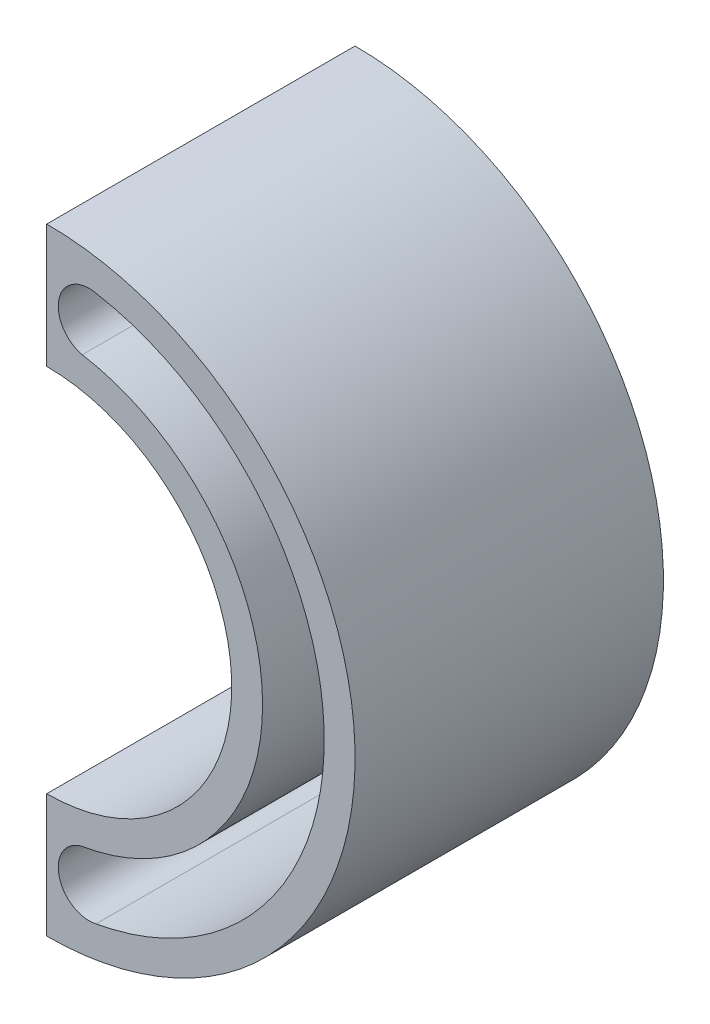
ISO-10303-21;
HEADER;
FILE_DESCRIPTION(('STEP AP214'),'2;1');
FILE_NAME('part.step','',(''),(''),'','','');
FILE_SCHEMA(('AUTOMOTIVE_DESIGN { 1 0 10303 214 1 1 1 1 }'));
ENDSEC;
DATA;
#1=APPLICATION_CONTEXT('core data for automotive mechanical design processes');
#2=APPLICATION_PROTOCOL_DEFINITION('international standard','automotive_design',2000,#1);
#3=PRODUCT_CONTEXT('',#1,'mechanical');
#4=PRODUCT('Part','Part','',(#3));
#5=PRODUCT_RELATED_PRODUCT_CATEGORY('part','',(#4));
#6=PRODUCT_DEFINITION_FORMATION('','',#4);
#7=PRODUCT_DEFINITION_CONTEXT('part definition',#1,'design');
#8=PRODUCT_DEFINITION('design','',#6,#7);
#9=PRODUCT_DEFINITION_SHAPE('','',#8);
#10=(LENGTH_UNIT() NAMED_UNIT(*) SI_UNIT(.MILLI.,.METRE.));
#11=(NAMED_UNIT(*) PLANE_ANGLE_UNIT() SI_UNIT($,.RADIAN.));
#12=(NAMED_UNIT(*) SI_UNIT($,.STERADIAN.) SOLID_ANGLE_UNIT());
#13=UNCERTAINTY_MEASURE_WITH_UNIT(LENGTH_MEASURE(1.E-05),#10,'distance_accuracy_value','');
#14=(GEOMETRIC_REPRESENTATION_CONTEXT(3) GLOBAL_UNCERTAINTY_ASSIGNED_CONTEXT((#13)) GLOBAL_UNIT_ASSIGNED_CONTEXT((#10,
#11,#12)) REPRESENTATION_CONTEXT('',''));
#15=CARTESIAN_POINT('',(0.,0.,0.));
#16=DIRECTION('',(0.,0.,1.));
#17=DIRECTION('',(1.,0.,0.));
#18=AXIS2_PLACEMENT_3D('',#15,#16,#17);
#19=CARTESIAN_POINT('',(0.,50.,50.));
#20=DIRECTION('',(1.,0.,0.));
#21=DIRECTION('',(0.,0.,-1.));
#22=AXIS2_PLACEMENT_3D('',#19,#20,#21);
#23=PLANE('',#22);
#24=DIRECTION('',(0.,-1.,0.));
#25=VECTOR('',#24,1.);
#26=CARTESIAN_POINT('',(0.,50.,0.));
#27=LINE('',#26,#25);
#28=CARTESIAN_POINT('',(0.,50.,0.));
#29=VERTEX_POINT('',#28);
#30=CARTESIAN_POINT('',(0.,30.,0.));
#31=VERTEX_POINT('',#30);
#32=EDGE_CURVE('E144',#29,#31,#27,.T.);
#33=ORIENTED_EDGE('',*,*,#32,.T.);
#34=DIRECTION('',(0.,0.,1.));
#35=VECTOR('',#34,1.);
#36=CARTESIAN_POINT('',(0.,30.,0.));
#37=LINE('',#36,#35);
#38=CARTESIAN_POINT('',(0.,30.,50.));
#39=VERTEX_POINT('',#38);
#40=EDGE_CURVE('E136',#31,#39,#37,.T.);
#41=ORIENTED_EDGE('',*,*,#40,.T.);
#42=DIRECTION('',(0.,-1.,0.));
#43=VECTOR('',#42,1.);
#44=CARTESIAN_POINT('',(0.,50.,50.));
#45=LINE('',#44,#43);
#46=CARTESIAN_POINT('',(0.,50.,50.));
#47=VERTEX_POINT('',#46);
#48=EDGE_CURVE('E151',#47,#39,#45,.T.);
#49=ORIENTED_EDGE('',*,*,#48,.F.);
#50=DIRECTION('',(0.,0.,-1.));
#51=VECTOR('',#50,1.);
#52=CARTESIAN_POINT('',(0.,50.,50.));
#53=LINE('',#52,#51);
#54=EDGE_CURVE('E11',#47,#29,#53,.T.);
#55=ORIENTED_EDGE('',*,*,#54,.T.);
#56=EDGE_LOOP('',(#33,#41,#49,#55));
#57=FACE_BOUND('',#56,.T.);
#58=ADVANCED_FACE('F29',(#57),#23,.F.);
#59=CARTESIAN_POINT('',(0.,0.,50.));
#60=DIRECTION('',(0.,0.,-1.));
#61=DIRECTION('',(-1.,0.,0.));
#62=AXIS2_PLACEMENT_3D('',#59,#60,#61);
#63=CYLINDRICAL_SURFACE('',#62,50.);
#64=CARTESIAN_POINT('',(0.,0.,0.));
#65=DIRECTION('',(0.,0.,1.));
#66=DIRECTION('',(-1.,0.,0.));
#67=AXIS2_PLACEMENT_3D('',#64,#65,#66);
#68=CIRCLE('',#67,50.);
#69=CARTESIAN_POINT('',(0.,-50.,0.));
#70=VERTEX_POINT('',#69);
#71=EDGE_CURVE('E139',#70,#29,#68,.T.);
#72=ORIENTED_EDGE('',*,*,#71,.T.);
#73=ORIENTED_EDGE('',*,*,#54,.F.);
#74=CARTESIAN_POINT('',(0.,0.,50.));
#75=DIRECTION('',(0.,0.,1.));
#76=DIRECTION('',(-1.,0.,0.));
#77=AXIS2_PLACEMENT_3D('',#74,#75,#76);
#78=CIRCLE('',#77,50.);
#79=CARTESIAN_POINT('',(0.,-50.,50.));
#80=VERTEX_POINT('',#79);
#81=EDGE_CURVE('E147',#80,#47,#78,.T.);
#82=ORIENTED_EDGE('',*,*,#81,.F.);
#83=DIRECTION('',(0.,0.,-1.));
#84=VECTOR('',#83,1.);
#85=CARTESIAN_POINT('',(0.,-50.,50.));
#86=LINE('',#85,#84);
#87=EDGE_CURVE('E37',#80,#70,#86,.T.);
#88=ORIENTED_EDGE('',*,*,#87,.T.);
#89=EDGE_LOOP('',(#72,#73,#82,#88));
#90=FACE_BOUND('',#89,.T.);
#91=ADVANCED_FACE('F31',(#90),#63,.T.);
#92=CARTESIAN_POINT('',(0.,-30.,50.));
#93=VERTEX_POINT('',#92);
#94=EDGE_CURVE('E150',#93,#80,#45,.T.);
#95=ORIENTED_EDGE('',*,*,#94,.F.);
#96=DIRECTION('',(0.,0.,1.));
#97=VECTOR('',#96,1.);
#98=CARTESIAN_POINT('',(0.,-30.,0.));
#99=LINE('',#98,#97);
#100=CARTESIAN_POINT('',(0.,-30.,0.));
#101=VERTEX_POINT('',#100);
#102=EDGE_CURVE('E135',#101,#93,#99,.T.);
#103=ORIENTED_EDGE('',*,*,#102,.F.);
#104=EDGE_CURVE('E143',#101,#70,#27,.T.);
#105=ORIENTED_EDGE('',*,*,#104,.T.);
#106=ORIENTED_EDGE('',*,*,#87,.F.);
#107=EDGE_LOOP('',(#95,#103,#105,#106));
#108=FACE_BOUND('',#107,.T.);
#109=ADVANCED_FACE('F167',(#108),#23,.F.);
#110=CARTESIAN_POINT('',(0.,0.,50.));
#111=DIRECTION('',(0.,0.,-1.));
#112=DIRECTION('',(-1.,0.,0.));
#113=AXIS2_PLACEMENT_3D('',#110,#111,#112);
#114=PLANE('',#113);
#115=CARTESIAN_POINT('',(0.,0.,50.));
#116=DIRECTION('',(0.,0.,-1.));
#117=DIRECTION('',(-1.,0.,0.));
#118=AXIS2_PLACEMENT_3D('',#115,#116,#117);
#119=CIRCLE('',#118,35.);
#120=CARTESIAN_POINT('',(5.75708361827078,34.5232673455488,50.));
#121=VERTEX_POINT('',#120);
#122=CARTESIAN_POINT('',(5.75708361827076,-34.5232673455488,50.));
#123=VERTEX_POINT('',#122);
#124=EDGE_CURVE('E105',#121,#123,#119,.T.);
#125=ORIENTED_EDGE('',*,*,#124,.F.);
#126=CARTESIAN_POINT('',(6.8785418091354,39.4032234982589,50.));
#127=DIRECTION('',(0.,0.,1.));
#128=DIRECTION('',(-1.,0.,0.));
#129=AXIS2_PLACEMENT_3D('',#126,#127,#128);
#130=CIRCLE('',#129,5.00715892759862);
#131=CARTESIAN_POINT('',(8.,44.283179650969,50.));
#132=VERTEX_POINT('',#131);
#133=EDGE_CURVE('E44',#132,#121,#130,.T.);
#134=ORIENTED_EDGE('',*,*,#133,.F.);
#135=CARTESIAN_POINT('',(0.,0.,50.));
#136=DIRECTION('',(0.,0.,1.));
#137=DIRECTION('',(-1.,0.,0.));
#138=AXIS2_PLACEMENT_3D('',#135,#136,#137);
#139=CIRCLE('',#138,45.);
#140=CARTESIAN_POINT('',(8.,-44.283179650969,50.));
#141=VERTEX_POINT('',#140);
#142=EDGE_CURVE('E112',#141,#132,#139,.T.);
#143=ORIENTED_EDGE('',*,*,#142,.F.);
#144=CARTESIAN_POINT('',(6.87854180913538,-39.4032234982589,50.));
#145=DIRECTION('',(0.,0.,1.));
#146=DIRECTION('',(-1.,0.,0.));
#147=AXIS2_PLACEMENT_3D('',#144,#145,#146);
#148=CIRCLE('',#147,5.00715892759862);
#149=EDGE_CURVE('E96',#123,#141,#148,.T.);
#150=ORIENTED_EDGE('',*,*,#149,.F.);
#151=EDGE_LOOP('',(#125,#134,#143,#150));
#152=FACE_BOUND('',#151,.T.);
#153=ORIENTED_EDGE('',*,*,#48,.T.);
#154=CARTESIAN_POINT('',(0.,0.,50.));
#155=DIRECTION('',(0.,0.,-1.));
#156=DIRECTION('',(-1.,0.,0.));
#157=AXIS2_PLACEMENT_3D('',#154,#155,#156);
#158=CIRCLE('',#157,30.);
#159=EDGE_CURVE('E128',#93,#39,#158,.F.);
#160=ORIENTED_EDGE('',*,*,#159,.F.);
#161=ORIENTED_EDGE('',*,*,#94,.T.);
#162=ORIENTED_EDGE('',*,*,#81,.T.);
#163=EDGE_LOOP('',(#153,#160,#161,#162));
#164=FACE_BOUND('',#163,.T.);
#165=ADVANCED_FACE('F109',(#152,#164),#114,.F.);
#166=CARTESIAN_POINT('',(0.,0.,0.));
#167=DIRECTION('',(0.,0.,-1.));
#168=DIRECTION('',(-1.,0.,0.));
#169=AXIS2_PLACEMENT_3D('',#166,#167,#168);
#170=PLANE('',#169);
#171=CARTESIAN_POINT('',(6.8785418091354,39.4032234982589,0.));
#172=DIRECTION('',(0.,0.,1.));
#173=DIRECTION('',(-1.,0.,0.));
#174=AXIS2_PLACEMENT_3D('',#171,#172,#173);
#175=CIRCLE('',#174,5.00715892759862);
#176=CARTESIAN_POINT('',(8.,44.283179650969,0.));
#177=VERTEX_POINT('',#176);
#178=CARTESIAN_POINT('',(5.75708361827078,34.5232673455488,0.));
#179=VERTEX_POINT('',#178);
#180=EDGE_CURVE('E114',#177,#179,#175,.T.);
#181=ORIENTED_EDGE('',*,*,#180,.T.);
#182=CARTESIAN_POINT('',(0.,0.,0.));
#183=DIRECTION('',(0.,0.,-1.));
#184=DIRECTION('',(-1.,0.,0.));
#185=AXIS2_PLACEMENT_3D('',#182,#183,#184);
#186=CIRCLE('',#185,35.);
#187=CARTESIAN_POINT('',(5.75708361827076,-34.5232673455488,0.));
#188=VERTEX_POINT('',#187);
#189=EDGE_CURVE('E120',#179,#188,#186,.T.);
#190=ORIENTED_EDGE('',*,*,#189,.T.);
#191=CARTESIAN_POINT('',(6.87854180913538,-39.4032234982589,0.));
#192=DIRECTION('',(0.,0.,1.));
#193=DIRECTION('',(-1.,0.,0.));
#194=AXIS2_PLACEMENT_3D('',#191,#192,#193);
#195=CIRCLE('',#194,5.00715892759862);
#196=CARTESIAN_POINT('',(8.,-44.283179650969,0.));
#197=VERTEX_POINT('',#196);
#198=EDGE_CURVE('E52',#188,#197,#195,.T.);
#199=ORIENTED_EDGE('',*,*,#198,.T.);
#200=CARTESIAN_POINT('',(0.,0.,0.));
#201=DIRECTION('',(0.,0.,1.));
#202=DIRECTION('',(-1.,0.,0.));
#203=AXIS2_PLACEMENT_3D('',#200,#201,#202);
#204=CIRCLE('',#203,45.);
#205=EDGE_CURVE('E123',#197,#177,#204,.T.);
#206=ORIENTED_EDGE('',*,*,#205,.T.);
#207=EDGE_LOOP('',(#181,#190,#199,#206));
#208=FACE_BOUND('',#207,.T.);
#209=CARTESIAN_POINT('',(0.,0.,0.));
#210=DIRECTION('',(0.,0.,-1.));
#211=DIRECTION('',(-1.,0.,0.));
#212=AXIS2_PLACEMENT_3D('',#209,#210,#211);
#213=CIRCLE('',#212,30.);
#214=EDGE_CURVE('E132',#101,#31,#213,.F.);
#215=ORIENTED_EDGE('',*,*,#214,.T.);
#216=ORIENTED_EDGE('',*,*,#32,.F.);
#217=ORIENTED_EDGE('',*,*,#71,.F.);
#218=ORIENTED_EDGE('',*,*,#104,.F.);
#219=EDGE_LOOP('',(#215,#216,#217,#218));
#220=FACE_BOUND('',#219,.T.);
#221=ADVANCED_FACE('F163',(#208,#220),#170,.T.);
#222=CARTESIAN_POINT('',(0.,0.,0.));
#223=DIRECTION('',(0.,0.,1.));
#224=DIRECTION('',(1.,0.,0.));
#225=AXIS2_PLACEMENT_3D('',#222,#223,#224);
#226=CYLINDRICAL_SURFACE('',#225,30.);
#227=ORIENTED_EDGE('',*,*,#159,.T.);
#228=ORIENTED_EDGE('',*,*,#40,.F.);
#229=ORIENTED_EDGE('',*,*,#214,.F.);
#230=ORIENTED_EDGE('',*,*,#102,.T.);
#231=EDGE_LOOP('',(#227,#228,#229,#230));
#232=FACE_BOUND('',#231,.T.);
#233=ADVANCED_FACE('F169',(#232),#226,.F.);
#234=CARTESIAN_POINT('',(6.8785418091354,39.4032234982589,0.));
#235=DIRECTION('',(0.,0.,1.));
#236=DIRECTION('',(1.,0.,0.));
#237=AXIS2_PLACEMENT_3D('',#234,#235,#236);
#238=CYLINDRICAL_SURFACE('',#237,5.00715892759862);
#239=ORIENTED_EDGE('',*,*,#133,.T.);
#240=DIRECTION('',(0.,0.,1.));
#241=VECTOR('',#240,1.);
#242=CARTESIAN_POINT('',(5.75708361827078,34.5232673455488,0.));
#243=LINE('',#242,#241);
#244=EDGE_CURVE('E102',#179,#121,#243,.T.);
#245=ORIENTED_EDGE('',*,*,#244,.F.);
#246=ORIENTED_EDGE('',*,*,#180,.F.);
#247=DIRECTION('',(0.,0.,1.));
#248=VECTOR('',#247,1.);
#249=CARTESIAN_POINT('',(8.,44.283179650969,0.));
#250=LINE('',#249,#248);
#251=EDGE_CURVE('E126',#177,#132,#250,.T.);
#252=ORIENTED_EDGE('',*,*,#251,.T.);
#253=EDGE_LOOP('',(#239,#245,#246,#252));
#254=FACE_BOUND('',#253,.T.);
#255=ADVANCED_FACE('F171',(#254),#238,.F.);
#256=CARTESIAN_POINT('',(0.,0.,0.));
#257=DIRECTION('',(0.,0.,1.));
#258=DIRECTION('',(1.,0.,0.));
#259=AXIS2_PLACEMENT_3D('',#256,#257,#258);
#260=CYLINDRICAL_SURFACE('',#259,45.);
#261=ORIENTED_EDGE('',*,*,#142,.T.);
#262=ORIENTED_EDGE('',*,*,#251,.F.);
#263=ORIENTED_EDGE('',*,*,#205,.F.);
#264=DIRECTION('',(0.,0.,1.));
#265=VECTOR('',#264,1.);
#266=CARTESIAN_POINT('',(8.,-44.283179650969,0.));
#267=LINE('',#266,#265);
#268=EDGE_CURVE('E101',#197,#141,#267,.T.);
#269=ORIENTED_EDGE('',*,*,#268,.T.);
#270=EDGE_LOOP('',(#261,#262,#263,#269));
#271=FACE_BOUND('',#270,.T.);
#272=ADVANCED_FACE('F178',(#271),#260,.F.);
#273=CARTESIAN_POINT('',(6.87854180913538,-39.4032234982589,0.));
#274=DIRECTION('',(0.,0.,1.));
#275=DIRECTION('',(1.,0.,0.));
#276=AXIS2_PLACEMENT_3D('',#273,#274,#275);
#277=CYLINDRICAL_SURFACE('',#276,5.00715892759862);
#278=ORIENTED_EDGE('',*,*,#149,.T.);
#279=ORIENTED_EDGE('',*,*,#268,.F.);
#280=ORIENTED_EDGE('',*,*,#198,.F.);
#281=DIRECTION('',(0.,0.,1.));
#282=VECTOR('',#281,1.);
#283=CARTESIAN_POINT('',(5.75708361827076,-34.5232673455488,0.));
#284=LINE('',#283,#282);
#285=EDGE_CURVE('E92',#188,#123,#284,.T.);
#286=ORIENTED_EDGE('',*,*,#285,.T.);
#287=EDGE_LOOP('',(#278,#279,#280,#286));
#288=FACE_BOUND('',#287,.T.);
#289=ADVANCED_FACE('F94',(#288),#277,.F.);
#290=CARTESIAN_POINT('',(0.,0.,0.));
#291=DIRECTION('',(0.,0.,1.));
#292=DIRECTION('',(1.,0.,0.));
#293=AXIS2_PLACEMENT_3D('',#290,#291,#292);
#294=CYLINDRICAL_SURFACE('',#293,35.);
#295=ORIENTED_EDGE('',*,*,#124,.T.);
#296=ORIENTED_EDGE('',*,*,#285,.F.);
#297=ORIENTED_EDGE('',*,*,#189,.F.);
#298=ORIENTED_EDGE('',*,*,#244,.T.);
#299=EDGE_LOOP('',(#295,#296,#297,#298));
#300=FACE_BOUND('',#299,.T.);
#301=ADVANCED_FACE('F106',(#300),#294,.T.);
#302=CLOSED_SHELL('',(#58,#91,#109,#165,#221,#233,#255,#272,#289,#301));
#303=MANIFOLD_SOLID_BREP('B2',#302);
#304=ADVANCED_BREP_SHAPE_REPRESENTATION('',(#18,#303),#14);
#305=SHAPE_DEFINITION_REPRESENTATION(#9,#304);
ENDSEC;
END-ISO-10303-21;
